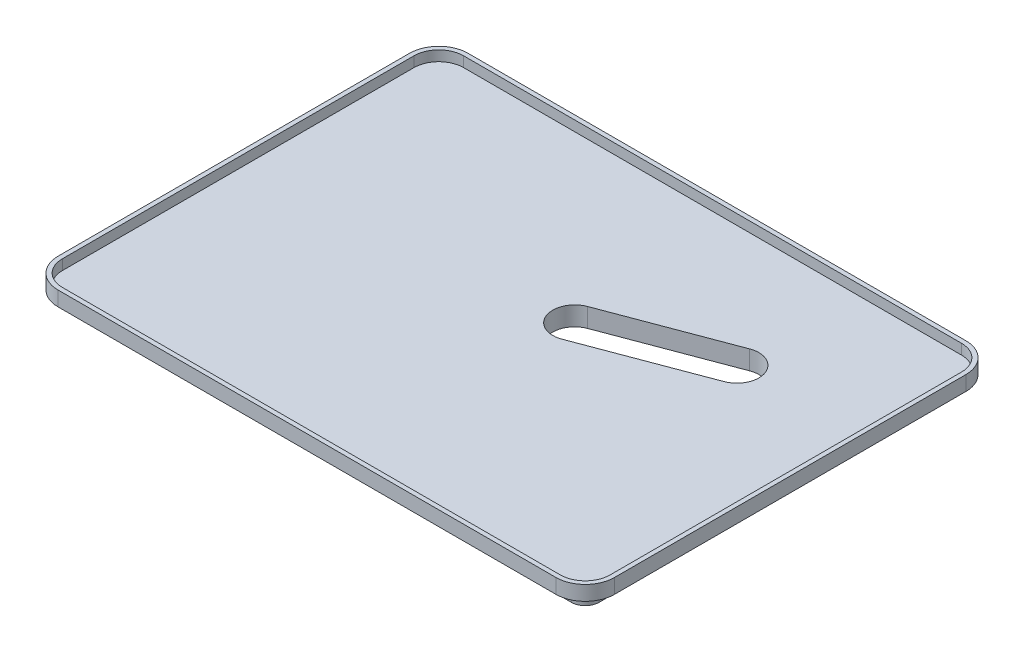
from build123d import *

# Parameters (mm, degrees)
EXTRUSION1_DEPTH        = 10
EXTRUSION1_DRAFT        = -3
EXTRUSION2_DEPTH        = 10
ENL_V_MAT_EXTRU_1_DEPTH = 7
ENL_V_MAT_EXTRU_2_DEPTH = 459.475735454


with BuildPart() as part:
    # Esquisse1 → Extrusion1 (with draft: the straight prism first)
    with BuildSketch(Plane(origin=(0, 0, 0), x_dir=(1, 0, 0), z_dir=(0, 1, 0))):
        with BuildLine():
            Line((10, 0), (350, 0))
            ThreePointArc((350, 0), (357.071067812, 2.928932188), (360, 10))
            Line((360, 10), (360, 250))
            ThreePointArc((360, 250), (357.071067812, 257.071067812), (350, 260))
            Line((350, 260), (10, 260))
            ThreePointArc((10, 260), (2.928932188, 257.071067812), (0, 250))
            Line((0, 250), (0, 10))
            ThreePointArc((0, 10), (2.928932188, 2.928932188), (10, 0))
        make_face()
    extrude(amount=-EXTRUSION1_DEPTH)
    # Extrusion1: the draft: its side faces are tilted about the plane it starts from
    extrusion1_sides = [part.faces().sort_by_distance(p)[0] for p in [
        (0, -5, -130),
        (2.928932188, -5, -2.928932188),
        (180, -5, 0),
        (357.071067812, -5, -2.928932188),
        (360, -5, -130),
        (357.071067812, -5, -257.071067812),
        (180, -5, -260),
        (2.928932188, -5, -257.071067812),
    ]]
    draft(extrusion1_sides, Plane(origin=(0, 0, 0), x_dir=(1, 0, 0), z_dir=(0, 1, 0)), EXTRUSION1_DRAFT)

    # Esquisse3 → Extrusion2 (add)
    with BuildSketch(Plane(origin=(0, 0, 0), x_dir=(-1, 0, 0), z_dir=(0, 1, 0))):
        with BuildLine():
            Line((-370, -10), (-370, -250))
            ThreePointArc((-370, -250), (-364.142135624, -264.142135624), (-350, -270))
            Line((-350, -270), (-10, -270))
            ThreePointArc((-10, -270), (4.142135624, -264.142135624), (10, -250))
            Line((10, -250), (10, -10))
            ThreePointArc((10, -10), (4.142135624, 4.142135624), (-10, 10))
            Line((-10, 10), (-350, 10))
            ThreePointArc((-350, 10), (-364.142135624, 4.142135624), (-370, -10))
        make_face()
    extrude(amount=EXTRUSION2_DEPTH)

    # Esquisse4 → Enl_v. mat.-Extru.1 (cut)
    with BuildSketch(Plane(origin=(0, 10, 0), x_dir=(-1, 0, 0), z_dir=(0, 1, 0))):
        with BuildLine():
            Line((-367, -10), (-367, -250))
            ThreePointArc((-367, -250), (-362.02081528, -262.02081528), (-350, -267))
            Line((-350, -267), (-10, -267))
            ThreePointArc((-10, -267), (2.02081528, -262.02081528), (7, -250))
            Line((7, -250), (7, -10))
            ThreePointArc((7, -10), (2.02081528, 2.02081528), (-10, 7))
            Line((-10, 7), (-350, 7))
            ThreePointArc((-350, 7), (-362.02081528, 2.02081528), (-367, -10))
        make_face()
    extrude(amount=-ENL_V_MAT_EXTRU_1_DEPTH, mode=Mode.SUBTRACT)

    # Esquisse5 → Enl_v. mat.-Extru.2 (cut, through all)
    with BuildSketch(Plane.XZ.offset(10)):
        with BuildLine():
            Line((284.580049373, -170.259652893), (204.085419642, -139.984009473))
            ThreePointArc((204.085419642, -139.984009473), (184.765023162, -148.743134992), (193.524148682, -168.063531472))
            Line((193.524148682, -168.063531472), (274.018778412, -198.339174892))
            ThreePointArc((274.018778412, -198.339174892), (293.339174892, -189.580049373), (284.580049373, -170.259652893))
        make_face()
    extrude(amount=-ENL_V_MAT_EXTRU_2_DEPTH, mode=Mode.SUBTRACT)


solid = part.part
